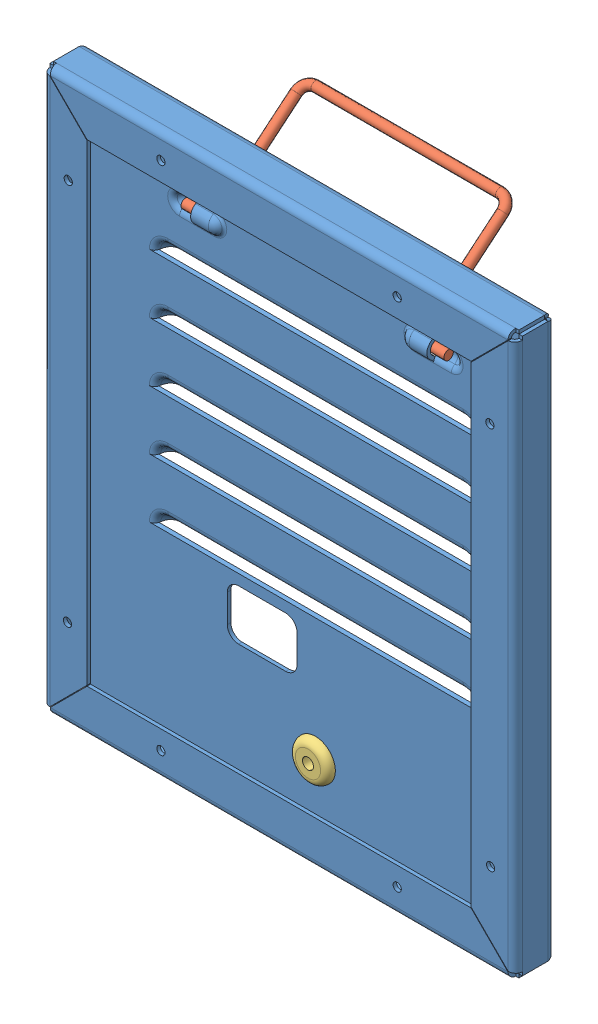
SolidWorks assembly Back Panel.SLDASM, configuration Default (file format 3100). Lengths in mm.
Overall size (203.22 241.32 58.27).
3 component instances, 3 part files, 5 mates.
Components (placement in the parent):
- GA_BKPANEL-1: GA_BKPANEL.SLDPRT [Default] at origin size (203.22 241.32 22.36)
- Handle-1: Handle.sldprt [Default] at (0 82.9135 -7.8105) x (-1 0 0) z (0 -0.768127 -0.640298) size (113.03 54.86 4.06)
- Grommet-1: Grommet.sldprt [Default] at (0 -95.5404 -7.8105) x (0.989146 -0.146938 0) z (0 0 1) size (17.17 17.17 7.87)
Mates (geometry in assembly coordinates):
- Concentric2: concentric anti-aligned: cylinder of GA_BKPANEL-1; cylinder of Grommet-1
- Coincident1: coincident anti-aligned: plane of GA_BKPANEL-1; plane of Grommet-1
- Coincident2: coincident anti-aligned: plane of GA_BKPANEL-1; plane of Handle-1
- Tangent1: tangent aligned: cylinder of GA_BKPANEL-1; cylinder of Handle-1
- Tangent2: tangent aligned: cylinder of GA_BKPANEL-1; cylinder of Handle-1
